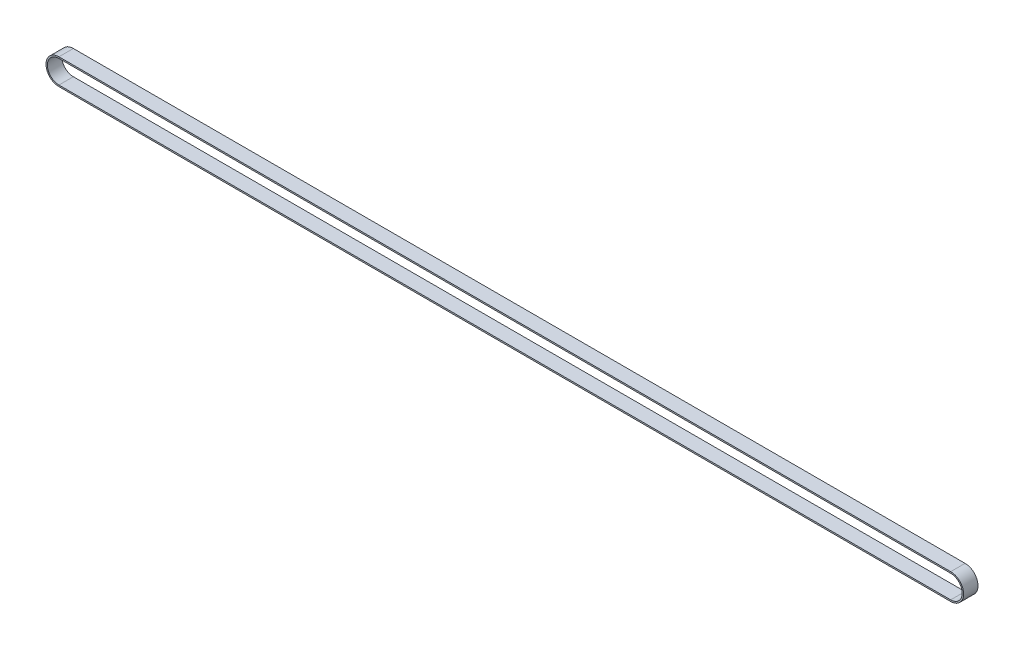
ISO-10303-21;
HEADER;
FILE_DESCRIPTION(('STEP AP214'),'2;1');
FILE_NAME('part.step','',(''),(''),'','','');
FILE_SCHEMA(('AUTOMOTIVE_DESIGN { 1 0 10303 214 1 1 1 1 }'));
ENDSEC;
DATA;
#1=APPLICATION_CONTEXT('core data for automotive mechanical design processes');
#2=APPLICATION_PROTOCOL_DEFINITION('international standard','automotive_design',2000,#1);
#3=PRODUCT_CONTEXT('',#1,'mechanical');
#4=PRODUCT('Part','Part','',(#3));
#5=PRODUCT_RELATED_PRODUCT_CATEGORY('part','',(#4));
#6=PRODUCT_DEFINITION_FORMATION('','',#4);
#7=PRODUCT_DEFINITION_CONTEXT('part definition',#1,'design');
#8=PRODUCT_DEFINITION('design','',#6,#7);
#9=PRODUCT_DEFINITION_SHAPE('','',#8);
#10=(LENGTH_UNIT() NAMED_UNIT(*) SI_UNIT(.MILLI.,.METRE.));
#11=(NAMED_UNIT(*) PLANE_ANGLE_UNIT() SI_UNIT($,.RADIAN.));
#12=(NAMED_UNIT(*) SI_UNIT($,.STERADIAN.) SOLID_ANGLE_UNIT());
#13=UNCERTAINTY_MEASURE_WITH_UNIT(LENGTH_MEASURE(1.E-05),#10,'distance_accuracy_value','');
#14=(GEOMETRIC_REPRESENTATION_CONTEXT(3) GLOBAL_UNCERTAINTY_ASSIGNED_CONTEXT((#13)) GLOBAL_UNIT_ASSIGNED_CONTEXT((#10,
#11,#12)) REPRESENTATION_CONTEXT('',''));
#15=CARTESIAN_POINT('',(0.,0.,0.));
#16=DIRECTION('',(0.,0.,1.));
#17=DIRECTION('',(1.,0.,0.));
#18=AXIS2_PLACEMENT_3D('',#15,#16,#17);
#19=CARTESIAN_POINT('',(310.,0.,5.));
#20=DIRECTION('',(0.,0.,-1.));
#21=DIRECTION('',(-1.,0.,0.));
#22=AXIS2_PLACEMENT_3D('',#19,#20,#21);
#23=PLANE('',#22);
#24=CARTESIAN_POINT('',(310.,0.,5.));
#25=DIRECTION('',(0.,0.,-1.));
#26=DIRECTION('',(-1.,0.,0.));
#27=AXIS2_PLACEMENT_3D('',#24,#25,#26);
#28=CIRCLE('',#27,4.5);
#29=CARTESIAN_POINT('',(310.,-4.5,5.));
#30=VERTEX_POINT('',#29);
#31=CARTESIAN_POINT('',(310.,4.5,5.));
#32=VERTEX_POINT('',#31);
#33=EDGE_CURVE('E162',#30,#32,#28,.F.);
#34=ORIENTED_EDGE('',*,*,#33,.T.);
#35=DIRECTION('',(-1.,0.,0.));
#36=VECTOR('',#35,1.);
#37=CARTESIAN_POINT('',(310.,4.5,5.));
#38=LINE('',#37,#36);
#39=CARTESIAN_POINT('',(0.,4.5,5.));
#40=VERTEX_POINT('',#39);
#41=EDGE_CURVE('E165',#32,#40,#38,.T.);
#42=ORIENTED_EDGE('',*,*,#41,.T.);
#43=CARTESIAN_POINT('',(0.,0.,5.));
#44=DIRECTION('',(0.,0.,-1.));
#45=DIRECTION('',(-1.,0.,0.));
#46=AXIS2_PLACEMENT_3D('',#43,#44,#45);
#47=CIRCLE('',#46,4.5);
#48=CARTESIAN_POINT('',(0.,-4.5,5.));
#49=VERTEX_POINT('',#48);
#50=EDGE_CURVE('E167',#40,#49,#47,.F.);
#51=ORIENTED_EDGE('',*,*,#50,.T.);
#52=DIRECTION('',(1.,0.,0.));
#53=VECTOR('',#52,1.);
#54=CARTESIAN_POINT('',(310.,-4.5,5.));
#55=LINE('',#54,#53);
#56=EDGE_CURVE('E169',#49,#30,#55,.T.);
#57=ORIENTED_EDGE('',*,*,#56,.T.);
#58=EDGE_LOOP('',(#34,#42,#51,#57));
#59=FACE_BOUND('',#58,.T.);
#60=CARTESIAN_POINT('',(310.,0.,5.));
#61=DIRECTION('',(0.,0.,1.));
#62=DIRECTION('',(-1.,0.,0.));
#63=AXIS2_PLACEMENT_3D('',#60,#61,#62);
#64=CIRCLE('',#63,4.);
#65=CARTESIAN_POINT('',(310.,-4.,5.));
#66=VERTEX_POINT('',#65);
#67=CARTESIAN_POINT('',(310.,4.,5.));
#68=VERTEX_POINT('',#67);
#69=EDGE_CURVE('E133',#66,#68,#64,.T.);
#70=ORIENTED_EDGE('',*,*,#69,.F.);
#71=DIRECTION('',(1.,0.,0.));
#72=VECTOR('',#71,1.);
#73=CARTESIAN_POINT('',(0.,-4.,5.));
#74=LINE('',#73,#72);
#75=CARTESIAN_POINT('',(0.,-4.,5.));
#76=VERTEX_POINT('',#75);
#77=EDGE_CURVE('E148',#76,#66,#74,.T.);
#78=ORIENTED_EDGE('',*,*,#77,.F.);
#79=CARTESIAN_POINT('',(0.,0.,5.));
#80=DIRECTION('',(0.,0.,1.));
#81=DIRECTION('',(1.,0.,0.));
#82=AXIS2_PLACEMENT_3D('',#79,#80,#81);
#83=CIRCLE('',#82,4.);
#84=CARTESIAN_POINT('',(0.,4.,5.));
#85=VERTEX_POINT('',#84);
#86=EDGE_CURVE('E146',#85,#76,#83,.T.);
#87=ORIENTED_EDGE('',*,*,#86,.F.);
#88=DIRECTION('',(-1.,0.,0.));
#89=VECTOR('',#88,1.);
#90=CARTESIAN_POINT('',(0.,4.,5.));
#91=LINE('',#90,#89);
#92=EDGE_CURVE('E144',#68,#85,#91,.T.);
#93=ORIENTED_EDGE('',*,*,#92,.F.);
#94=EDGE_LOOP('',(#70,#78,#87,#93));
#95=FACE_BOUND('',#94,.T.);
#96=ADVANCED_FACE('F53',(#59,#95),#23,.F.);
#97=CARTESIAN_POINT('',(310.,0.,0.));
#98=DIRECTION('',(0.,0.,-1.));
#99=DIRECTION('',(-1.,0.,0.));
#100=AXIS2_PLACEMENT_3D('',#97,#98,#99);
#101=PLANE('',#100);
#102=CARTESIAN_POINT('',(310.,0.,0.));
#103=DIRECTION('',(0.,0.,-1.));
#104=DIRECTION('',(-1.,0.,0.));
#105=AXIS2_PLACEMENT_3D('',#102,#103,#104);
#106=CIRCLE('',#105,4.5);
#107=CARTESIAN_POINT('',(310.,-4.5,0.));
#108=VERTEX_POINT('',#107);
#109=CARTESIAN_POINT('',(310.,4.5,0.));
#110=VERTEX_POINT('',#109);
#111=EDGE_CURVE('E134',#108,#110,#106,.F.);
#112=ORIENTED_EDGE('',*,*,#111,.F.);
#113=DIRECTION('',(1.,0.,0.));
#114=VECTOR('',#113,1.);
#115=CARTESIAN_POINT('',(310.,-4.5,0.));
#116=LINE('',#115,#114);
#117=CARTESIAN_POINT('',(0.,-4.5,0.));
#118=VERTEX_POINT('',#117);
#119=EDGE_CURVE('E160',#118,#108,#116,.T.);
#120=ORIENTED_EDGE('',*,*,#119,.F.);
#121=CARTESIAN_POINT('',(0.,0.,0.));
#122=DIRECTION('',(0.,0.,-1.));
#123=DIRECTION('',(-1.,0.,0.));
#124=AXIS2_PLACEMENT_3D('',#121,#122,#123);
#125=CIRCLE('',#124,4.5);
#126=CARTESIAN_POINT('',(0.,4.5,0.));
#127=VERTEX_POINT('',#126);
#128=EDGE_CURVE('E158',#127,#118,#125,.F.);
#129=ORIENTED_EDGE('',*,*,#128,.F.);
#130=DIRECTION('',(-1.,0.,0.));
#131=VECTOR('',#130,1.);
#132=CARTESIAN_POINT('',(310.,4.5,0.));
#133=LINE('',#132,#131);
#134=EDGE_CURVE('E156',#110,#127,#133,.T.);
#135=ORIENTED_EDGE('',*,*,#134,.F.);
#136=EDGE_LOOP('',(#112,#120,#129,#135));
#137=FACE_BOUND('',#136,.T.);
#138=DIRECTION('',(1.,0.,0.));
#139=VECTOR('',#138,1.);
#140=CARTESIAN_POINT('',(0.,-4.,0.));
#141=LINE('',#140,#139);
#142=CARTESIAN_POINT('',(0.,-4.,0.));
#143=VERTEX_POINT('',#142);
#144=CARTESIAN_POINT('',(310.,-4.,0.));
#145=VERTEX_POINT('',#144);
#146=EDGE_CURVE('E138',#143,#145,#141,.T.);
#147=ORIENTED_EDGE('',*,*,#146,.T.);
#148=CARTESIAN_POINT('',(310.,0.,0.));
#149=DIRECTION('',(0.,0.,1.));
#150=DIRECTION('',(-1.,0.,0.));
#151=AXIS2_PLACEMENT_3D('',#148,#149,#150);
#152=CIRCLE('',#151,4.);
#153=CARTESIAN_POINT('',(310.,4.,0.));
#154=VERTEX_POINT('',#153);
#155=EDGE_CURVE('E76',#145,#154,#152,.T.);
#156=ORIENTED_EDGE('',*,*,#155,.T.);
#157=DIRECTION('',(-1.,0.,0.));
#158=VECTOR('',#157,1.);
#159=CARTESIAN_POINT('',(0.,4.,0.));
#160=LINE('',#159,#158);
#161=CARTESIAN_POINT('',(0.,4.,0.));
#162=VERTEX_POINT('',#161);
#163=EDGE_CURVE('E120',#154,#162,#160,.T.);
#164=ORIENTED_EDGE('',*,*,#163,.T.);
#165=CARTESIAN_POINT('',(0.,0.,0.));
#166=DIRECTION('',(0.,0.,1.));
#167=DIRECTION('',(1.,0.,0.));
#168=AXIS2_PLACEMENT_3D('',#165,#166,#167);
#169=CIRCLE('',#168,4.);
#170=EDGE_CURVE('E129',#162,#143,#169,.T.);
#171=ORIENTED_EDGE('',*,*,#170,.T.);
#172=EDGE_LOOP('',(#147,#156,#164,#171));
#173=FACE_BOUND('',#172,.T.);
#174=ADVANCED_FACE('F137',(#137,#173),#101,.T.);
#175=CARTESIAN_POINT('',(310.,0.,5.));
#176=DIRECTION('',(0.,0.,-1.));
#177=DIRECTION('',(-1.,0.,0.));
#178=AXIS2_PLACEMENT_3D('',#175,#176,#177);
#179=CYLINDRICAL_SURFACE('',#178,4.5);
#180=ORIENTED_EDGE('',*,*,#111,.T.);
#181=DIRECTION('',(0.,0.,-1.));
#182=VECTOR('',#181,1.);
#183=CARTESIAN_POINT('',(310.,4.5,5.));
#184=LINE('',#183,#182);
#185=EDGE_CURVE('E12',#32,#110,#184,.T.);
#186=ORIENTED_EDGE('',*,*,#185,.F.);
#187=ORIENTED_EDGE('',*,*,#33,.F.);
#188=DIRECTION('',(0.,0.,-1.));
#189=VECTOR('',#188,1.);
#190=CARTESIAN_POINT('',(310.,-4.5,5.));
#191=LINE('',#190,#189);
#192=EDGE_CURVE('E171',#30,#108,#191,.T.);
#193=ORIENTED_EDGE('',*,*,#192,.T.);
#194=EDGE_LOOP('',(#180,#186,#187,#193));
#195=FACE_BOUND('',#194,.T.);
#196=ADVANCED_FACE('F55',(#195),#179,.T.);
#197=CARTESIAN_POINT('',(310.,4.5,5.));
#198=DIRECTION('',(0.,-1.,0.));
#199=DIRECTION('',(0.,0.,-1.));
#200=AXIS2_PLACEMENT_3D('',#197,#198,#199);
#201=PLANE('',#200);
#202=ORIENTED_EDGE('',*,*,#134,.T.);
#203=DIRECTION('',(0.,0.,-1.));
#204=VECTOR('',#203,1.);
#205=CARTESIAN_POINT('',(0.,4.5,5.));
#206=LINE('',#205,#204);
#207=EDGE_CURVE('E61',#40,#127,#206,.T.);
#208=ORIENTED_EDGE('',*,*,#207,.F.);
#209=ORIENTED_EDGE('',*,*,#41,.F.);
#210=ORIENTED_EDGE('',*,*,#185,.T.);
#211=EDGE_LOOP('',(#202,#208,#209,#210));
#212=FACE_BOUND('',#211,.T.);
#213=ADVANCED_FACE('F196',(#212),#201,.F.);
#214=CARTESIAN_POINT('',(0.,0.,5.));
#215=DIRECTION('',(0.,0.,-1.));
#216=DIRECTION('',(-1.,0.,0.));
#217=AXIS2_PLACEMENT_3D('',#214,#215,#216);
#218=CYLINDRICAL_SURFACE('',#217,4.5);
#219=ORIENTED_EDGE('',*,*,#128,.T.);
#220=DIRECTION('',(0.,0.,-1.));
#221=VECTOR('',#220,1.);
#222=CARTESIAN_POINT('',(0.,-4.5,5.));
#223=LINE('',#222,#221);
#224=EDGE_CURVE('E174',#49,#118,#223,.T.);
#225=ORIENTED_EDGE('',*,*,#224,.F.);
#226=ORIENTED_EDGE('',*,*,#50,.F.);
#227=ORIENTED_EDGE('',*,*,#207,.T.);
#228=EDGE_LOOP('',(#219,#225,#226,#227));
#229=FACE_BOUND('',#228,.T.);
#230=ADVANCED_FACE('F181',(#229),#218,.T.);
#231=CARTESIAN_POINT('',(310.,-4.5,5.));
#232=DIRECTION('',(0.,1.,0.));
#233=DIRECTION('',(0.,0.,1.));
#234=AXIS2_PLACEMENT_3D('',#231,#232,#233);
#235=PLANE('',#234);
#236=ORIENTED_EDGE('',*,*,#119,.T.);
#237=ORIENTED_EDGE('',*,*,#192,.F.);
#238=ORIENTED_EDGE('',*,*,#56,.F.);
#239=ORIENTED_EDGE('',*,*,#224,.T.);
#240=EDGE_LOOP('',(#236,#237,#238,#239));
#241=FACE_BOUND('',#240,.T.);
#242=ADVANCED_FACE('F189',(#241),#235,.F.);
#243=CARTESIAN_POINT('',(310.,0.,5.));
#244=DIRECTION('',(0.,0.,-1.));
#245=DIRECTION('',(-1.,0.,0.));
#246=AXIS2_PLACEMENT_3D('',#243,#244,#245);
#247=CYLINDRICAL_SURFACE('',#246,4.);
#248=ORIENTED_EDGE('',*,*,#155,.F.);
#249=DIRECTION('',(0.,0.,-1.));
#250=VECTOR('',#249,1.);
#251=CARTESIAN_POINT('',(310.,-4.,5.));
#252=LINE('',#251,#250);
#253=EDGE_CURVE('E150',#66,#145,#252,.T.);
#254=ORIENTED_EDGE('',*,*,#253,.F.);
#255=ORIENTED_EDGE('',*,*,#69,.T.);
#256=DIRECTION('',(0.,0.,-1.));
#257=VECTOR('',#256,1.);
#258=CARTESIAN_POINT('',(310.,4.,5.));
#259=LINE('',#258,#257);
#260=EDGE_CURVE('E122',#68,#154,#259,.T.);
#261=ORIENTED_EDGE('',*,*,#260,.T.);
#262=EDGE_LOOP('',(#248,#254,#255,#261));
#263=FACE_BOUND('',#262,.T.);
#264=ADVANCED_FACE('F131',(#263),#247,.F.);
#265=CARTESIAN_POINT('',(0.,4.,5.));
#266=DIRECTION('',(0.,-1.,0.));
#267=DIRECTION('',(0.,0.,-1.));
#268=AXIS2_PLACEMENT_3D('',#265,#266,#267);
#269=PLANE('',#268);
#270=ORIENTED_EDGE('',*,*,#163,.F.);
#271=ORIENTED_EDGE('',*,*,#260,.F.);
#272=ORIENTED_EDGE('',*,*,#92,.T.);
#273=DIRECTION('',(0.,0.,-1.));
#274=VECTOR('',#273,1.);
#275=CARTESIAN_POINT('',(0.,4.,5.));
#276=LINE('',#275,#274);
#277=EDGE_CURVE('E125',#85,#162,#276,.T.);
#278=ORIENTED_EDGE('',*,*,#277,.T.);
#279=EDGE_LOOP('',(#270,#271,#272,#278));
#280=FACE_BOUND('',#279,.T.);
#281=ADVANCED_FACE('F121',(#280),#269,.T.);
#282=CARTESIAN_POINT('',(0.,0.,5.));
#283=DIRECTION('',(0.,0.,-1.));
#284=DIRECTION('',(-1.,0.,0.));
#285=AXIS2_PLACEMENT_3D('',#282,#283,#284);
#286=CYLINDRICAL_SURFACE('',#285,4.);
#287=ORIENTED_EDGE('',*,*,#170,.F.);
#288=ORIENTED_EDGE('',*,*,#277,.F.);
#289=ORIENTED_EDGE('',*,*,#86,.T.);
#290=DIRECTION('',(0.,0.,-1.));
#291=VECTOR('',#290,1.);
#292=CARTESIAN_POINT('',(0.,-4.,5.));
#293=LINE('',#292,#291);
#294=EDGE_CURVE('E68',#76,#143,#293,.T.);
#295=ORIENTED_EDGE('',*,*,#294,.T.);
#296=EDGE_LOOP('',(#287,#288,#289,#295));
#297=FACE_BOUND('',#296,.T.);
#298=ADVANCED_FACE('F218',(#297),#286,.F.);
#299=CARTESIAN_POINT('',(0.,-4.,5.));
#300=DIRECTION('',(0.,1.,0.));
#301=DIRECTION('',(0.,0.,1.));
#302=AXIS2_PLACEMENT_3D('',#299,#300,#301);
#303=PLANE('',#302);
#304=ORIENTED_EDGE('',*,*,#146,.F.);
#305=ORIENTED_EDGE('',*,*,#294,.F.);
#306=ORIENTED_EDGE('',*,*,#77,.T.);
#307=ORIENTED_EDGE('',*,*,#253,.T.);
#308=EDGE_LOOP('',(#304,#305,#306,#307));
#309=FACE_BOUND('',#308,.T.);
#310=ADVANCED_FACE('F223',(#309),#303,.T.);
#311=CLOSED_SHELL('',(#96,#174,#196,#213,#230,#242,#264,#281,#298,#310));
#312=MANIFOLD_SOLID_BREP('B2',#311);
#313=ADVANCED_BREP_SHAPE_REPRESENTATION('',(#18,#312),#14);
#314=SHAPE_DEFINITION_REPRESENTATION(#9,#313);
ENDSEC;
END-ISO-10303-21;
